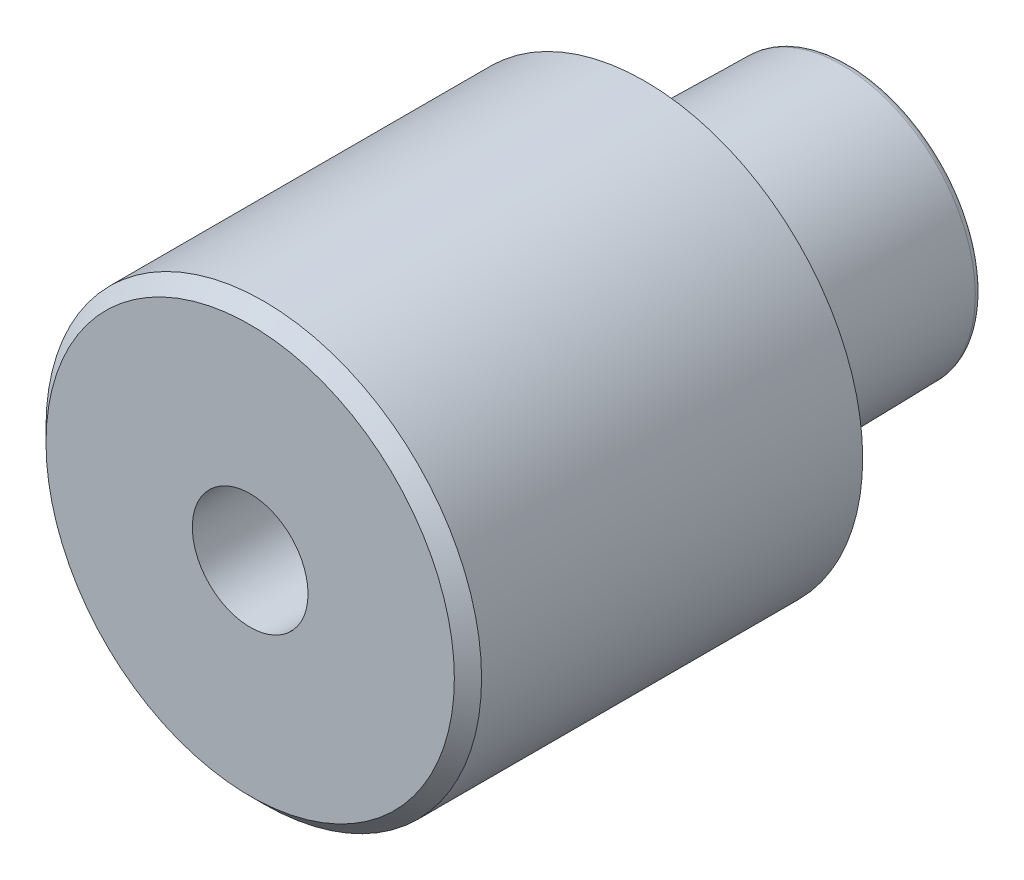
ISO-10303-21;
HEADER;
FILE_DESCRIPTION(('STEP AP214'),'2;1');
FILE_NAME('part.step','',(''),(''),'','','');
FILE_SCHEMA(('AUTOMOTIVE_DESIGN { 1 0 10303 214 1 1 1 1 }'));
ENDSEC;
DATA;
#1=APPLICATION_CONTEXT('core data for automotive mechanical design processes');
#2=APPLICATION_PROTOCOL_DEFINITION('international standard','automotive_design',2000,#1);
#3=PRODUCT_CONTEXT('',#1,'mechanical');
#4=PRODUCT('Part','Part','',(#3));
#5=PRODUCT_RELATED_PRODUCT_CATEGORY('part','',(#4));
#6=PRODUCT_DEFINITION_FORMATION('','',#4);
#7=PRODUCT_DEFINITION_CONTEXT('part definition',#1,'design');
#8=PRODUCT_DEFINITION('design','',#6,#7);
#9=PRODUCT_DEFINITION_SHAPE('','',#8);
#10=(LENGTH_UNIT() NAMED_UNIT(*) SI_UNIT(.MILLI.,.METRE.));
#11=(NAMED_UNIT(*) PLANE_ANGLE_UNIT() SI_UNIT($,.RADIAN.));
#12=(NAMED_UNIT(*) SI_UNIT($,.STERADIAN.) SOLID_ANGLE_UNIT());
#13=UNCERTAINTY_MEASURE_WITH_UNIT(LENGTH_MEASURE(1.E-05),#10,'distance_accuracy_value','');
#14=(GEOMETRIC_REPRESENTATION_CONTEXT(3) GLOBAL_UNCERTAINTY_ASSIGNED_CONTEXT((#13)) GLOBAL_UNIT_ASSIGNED_CONTEXT((#10,
#11,#12)) REPRESENTATION_CONTEXT('',''));
#15=CARTESIAN_POINT('',(0.,0.,0.));
#16=DIRECTION('',(0.,0.,1.));
#17=DIRECTION('',(1.,0.,0.));
#18=AXIS2_PLACEMENT_3D('',#15,#16,#17);
#19=CARTESIAN_POINT('',(1.56226912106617E-13,0.,22.3725830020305));
#20=DIRECTION('',(0.,0.,-1.));
#21=DIRECTION('',(1.,0.,0.));
#22=AXIS2_PLACEMENT_3D('',#19,#20,#21);
#23=CONICAL_SURFACE('',#22,22.6274169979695,0.785398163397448);
#24=CARTESIAN_POINT('',(2.09488880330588E-13,0.,30.));
#25=DIRECTION('',(0.,0.,-1.));
#26=DIRECTION('',(-1.,0.,0.));
#27=AXIS2_PLACEMENT_3D('',#24,#25,#26);
#28=CIRCLE('',#27,15.);
#29=CARTESIAN_POINT('',(-14.9999999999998,0.,30.));
#30=VERTEX_POINT('',#29);
#31=CARTESIAN_POINT('',(15.,0.,30.));
#32=VERTEX_POINT('',#31);
#33=EDGE_CURVE('E59',#30,#32,#28,.T.);
#34=ORIENTED_EDGE('',*,*,#33,.T.);
#35=CARTESIAN_POINT('',(15.0000010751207,0.,29.9999989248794));
#36=CARTESIAN_POINT('',(16.0000024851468,0.,28.9999975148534));
#37=B_SPLINE_CURVE_WITH_KNOTS('',1,(#35,#36),.UNSPECIFIED.,.F.,.F.,(2,2),(0.662912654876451,
0.707106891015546),.UNSPECIFIED.);
#38=CARTESIAN_POINT('',(16.,0.,29.));
#39=VERTEX_POINT('',#38);
#40=EDGE_CURVE('E46',#32,#39,#37,.T.);
#41=ORIENTED_EDGE('',*,*,#40,.T.);
#42=CARTESIAN_POINT('',(2.02505917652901E-13,0.,29.));
#43=DIRECTION('',(0.,0.,1.));
#44=DIRECTION('',(-1.,0.,0.));
#45=AXIS2_PLACEMENT_3D('',#42,#43,#44);
#46=CIRCLE('',#45,16.);
#47=CARTESIAN_POINT('',(-16.,0.,29.));
#48=VERTEX_POINT('',#47);
#49=EDGE_CURVE('E97',#39,#48,#46,.T.);
#50=ORIENTED_EDGE('',*,*,#49,.T.);
#51=CARTESIAN_POINT('',(2.02505917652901E-13,0.,29.));
#52=DIRECTION('',(0.,0.,1.));
#53=DIRECTION('',(-1.,0.,0.));
#54=AXIS2_PLACEMENT_3D('',#51,#52,#53);
#55=CIRCLE('',#54,16.);
#56=EDGE_CURVE('E11',#48,#39,#55,.T.);
#57=ORIENTED_EDGE('',*,*,#56,.T.);
#58=ORIENTED_EDGE('',*,*,#40,.F.);
#59=CARTESIAN_POINT('',(2.09488880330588E-13,0.,30.));
#60=DIRECTION('',(0.,0.,-1.));
#61=DIRECTION('',(-1.,0.,0.));
#62=AXIS2_PLACEMENT_3D('',#59,#60,#61);
#63=CIRCLE('',#62,15.);
#64=EDGE_CURVE('E94',#32,#30,#63,.T.);
#65=ORIENTED_EDGE('',*,*,#64,.T.);
#66=EDGE_LOOP('',(#34,#41,#50,#57,#58,#65));
#67=FACE_BOUND('',#66,.T.);
#68=ADVANCED_FACE('F38',(#67),#23,.T.);
#69=CARTESIAN_POINT('',(1.08235921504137E-13,0.,15.5));
#70=DIRECTION('',(0.,0.,-1.));
#71=DIRECTION('',(-1.,0.,0.));
#72=AXIS2_PLACEMENT_3D('',#69,#70,#71);
#73=CYLINDRICAL_SURFACE('',#72,16.);
#74=ORIENTED_EDGE('',*,*,#49,.F.);
#75=ORIENTED_EDGE('',*,*,#56,.F.);
#76=CARTESIAN_POINT('',(-16.,0.,29.0000010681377));
#77=CARTESIAN_POINT('',(-16.,0.,1.00000036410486));
#78=B_SPLINE_CURVE_WITH_KNOTS('',1,(#76,#77),.UNSPECIFIED.,.F.,.F.,(2,2),(0.0833333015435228,
0.916666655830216),.UNSPECIFIED.);
#79=CARTESIAN_POINT('',(-16.,0.,1.00000000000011));
#80=VERTEX_POINT('',#79);
#81=EDGE_CURVE('E132',#48,#80,#78,.T.);
#82=ORIENTED_EDGE('',*,*,#81,.T.);
#83=CARTESIAN_POINT('',(0.,0.,1.));
#84=DIRECTION('',(0.,0.,-1.));
#85=DIRECTION('',(-1.,0.,0.));
#86=AXIS2_PLACEMENT_3D('',#83,#84,#85);
#87=CIRCLE('',#86,16.);
#88=EDGE_CURVE('E137',#80,#80,#87,.T.);
#89=ORIENTED_EDGE('',*,*,#88,.F.);
#90=ORIENTED_EDGE('',*,*,#81,.F.);
#91=EDGE_LOOP('',(#74,#75,#82,#89,#90));
#92=FACE_BOUND('',#91,.T.);
#93=ADVANCED_FACE('F182',(#92),#73,.T.);
#94=CARTESIAN_POINT('',(-19.5,-31.1769145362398,30.));
#95=DIRECTION('',(0.,0.,1.));
#96=DIRECTION('',(1.,0.,0.));
#97=AXIS2_PLACEMENT_3D('',#94,#95,#96);
#98=PLANE('',#97);
#99=CARTESIAN_POINT('',(2.09488880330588E-13,0.,29.9999999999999));
#100=DIRECTION('',(0.,0.,1.));
#101=DIRECTION('',(1.,0.,0.));
#102=AXIS2_PLACEMENT_3D('',#99,#100,#101);
#103=CIRCLE('',#102,4.24999999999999);
#104=CARTESIAN_POINT('',(4.2500000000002,0.,29.9999999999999));
#105=VERTEX_POINT('',#104);
#106=EDGE_CURVE('E95',#105,#105,#103,.T.);
#107=ORIENTED_EDGE('',*,*,#106,.F.);
#108=EDGE_LOOP('',(#107));
#109=FACE_BOUND('',#108,.T.);
#110=ORIENTED_EDGE('',*,*,#64,.F.);
#111=ORIENTED_EDGE('',*,*,#33,.F.);
#112=EDGE_LOOP('',(#110,#111));
#113=FACE_BOUND('',#112,.T.);
#114=ADVANCED_FACE('F185',(#109,#113),#98,.T.);
#115=CARTESIAN_POINT('',(0.,0.,-13.5));
#116=DIRECTION('',(0.,0.,-1.));
#117=DIRECTION('',(-1.,0.,0.));
#118=AXIS2_PLACEMENT_3D('',#115,#116,#117);
#119=TOROIDAL_SURFACE('',#118,9.26428045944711,0.5);
#120=CARTESIAN_POINT('',(0.,0.,-13.5087262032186));
#121=DIRECTION('',(0.,0.,-1.));
#122=DIRECTION('',(-1.,0.,0.));
#123=AXIS2_PLACEMENT_3D('',#120,#121,#122);
#124=CIRCLE('',#123,9.76420430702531);
#125=CARTESIAN_POINT('',(-9.7642043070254,0.,-13.5087262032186));
#126=VERTEX_POINT('',#125);
#127=EDGE_CURVE('E138',#126,#126,#124,.T.);
#128=ORIENTED_EDGE('',*,*,#127,.T.);
#129=CARTESIAN_POINT('',(-9.7642043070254,0.,-13.5087262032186));
#130=CARTESIAN_POINT('',(-9.75562909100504,0.,-13.9999999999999));
#131=CARTESIAN_POINT('',(-9.26428045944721,0.,-14.));
#132=(BOUNDED_CURVE() B_SPLINE_CURVE(2,(#129,#130,#131),.UNSPECIFIED.,.F.,
.F.) B_SPLINE_CURVE_WITH_KNOTS((3,3),(0.,0.5),
.UNSPECIFIED.) CURVE() GEOMETRIC_REPRESENTATION_ITEM() RATIONAL_B_SPLINE_CURVE((1.,
0.713250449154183,1.)) REPRESENTATION_ITEM(''));
#133=CARTESIAN_POINT('',(-9.26428045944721,0.,-14.));
#134=VERTEX_POINT('',#133);
#135=EDGE_CURVE('E121',#126,#134,#132,.T.);
#136=ORIENTED_EDGE('',*,*,#135,.T.);
#137=CARTESIAN_POINT('',(0.,0.,-14.));
#138=DIRECTION('',(0.,0.,1.));
#139=DIRECTION('',(-1.,0.,0.));
#140=AXIS2_PLACEMENT_3D('',#137,#138,#139);
#141=CIRCLE('',#140,9.26428045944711);
#142=EDGE_CURVE('E127',#134,#134,#141,.T.);
#143=ORIENTED_EDGE('',*,*,#142,.T.);
#144=ORIENTED_EDGE('',*,*,#135,.F.);
#145=EDGE_LOOP('',(#128,#136,#143,#144));
#146=FACE_BOUND('',#145,.T.);
#147=ADVANCED_FACE('F187',(#146),#119,.T.);
#148=CARTESIAN_POINT('',(0.,0.,0.));
#149=DIRECTION('',(0.,0.,1.));
#150=DIRECTION('',(-1.,0.,0.));
#151=AXIS2_PLACEMENT_3D('',#148,#149,#150);
#152=CONICAL_SURFACE('',#151,10.,0.0174532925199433);
#153=ORIENTED_EDGE('',*,*,#127,.F.);
#154=CARTESIAN_POINT('',(-9.7642043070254,0.,-13.5087262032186));
#155=CARTESIAN_POINT('',(-10.,0.,0.));
#156=B_SPLINE_CURVE_WITH_KNOTS('',1,(#154,#155),.UNSPECIFIED.,.F.,.F.,(2,2),(0.,1.),.UNSPECIFIED.);
#157=CARTESIAN_POINT('',(-10.,0.,0.));
#158=VERTEX_POINT('',#157);
#159=EDGE_CURVE('E110',#126,#158,#156,.T.);
#160=ORIENTED_EDGE('',*,*,#159,.T.);
#161=CARTESIAN_POINT('',(0.,0.,0.));
#162=DIRECTION('',(0.,0.,-1.));
#163=DIRECTION('',(-1.,0.,0.));
#164=AXIS2_PLACEMENT_3D('',#161,#162,#163);
#165=CIRCLE('',#164,10.);
#166=EDGE_CURVE('E116',#158,#158,#165,.T.);
#167=ORIENTED_EDGE('',*,*,#166,.T.);
#168=ORIENTED_EDGE('',*,*,#159,.F.);
#169=EDGE_LOOP('',(#153,#160,#167,#168));
#170=FACE_BOUND('',#169,.T.);
#171=ADVANCED_FACE('F194',(#170),#152,.T.);
#172=CARTESIAN_POINT('',(21.3078450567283,-19.2554453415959,-14.0000000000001));
#173=DIRECTION('',(0.,0.,-1.));
#174=DIRECTION('',(-1.,0.,0.));
#175=AXIS2_PLACEMENT_3D('',#172,#173,#174);
#176=PLANE('',#175);
#177=ORIENTED_EDGE('',*,*,#142,.F.);
#178=EDGE_LOOP('',(#177));
#179=FACE_BOUND('',#178,.T.);
#180=ADVANCED_FACE('F222',(#179),#176,.T.);
#181=CARTESIAN_POINT('',(0.,0.,0.5));
#182=DIRECTION('',(0.,0.,-1.));
#183=DIRECTION('',(-1.,0.,0.));
#184=AXIS2_PLACEMENT_3D('',#181,#182,#183);
#185=CYLINDRICAL_SURFACE('',#184,10.);
#186=CARTESIAN_POINT('',(0.,0.,1.));
#187=DIRECTION('',(0.,0.,1.));
#188=DIRECTION('',(-1.,0.,0.));
#189=AXIS2_PLACEMENT_3D('',#186,#187,#188);
#190=CIRCLE('',#189,10.);
#191=CARTESIAN_POINT('',(-10.,0.,1.00000000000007));
#192=VERTEX_POINT('',#191);
#193=EDGE_CURVE('E105',#192,#192,#190,.T.);
#194=ORIENTED_EDGE('',*,*,#193,.F.);
#195=CARTESIAN_POINT('',(-10.,0.,1.00000305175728));
#196=CARTESIAN_POINT('',(-10.,0.,5.31746945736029E-07));
#197=B_SPLINE_CURVE_WITH_KNOTS('',1,(#195,#196),.UNSPECIFIED.,.F.,.F.,(2,2),(0.0833307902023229,
0.91666622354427),.UNSPECIFIED.);
#198=EDGE_CURVE('E102',#192,#158,#197,.T.);
#199=ORIENTED_EDGE('',*,*,#198,.T.);
#200=ORIENTED_EDGE('',*,*,#166,.F.);
#201=ORIENTED_EDGE('',*,*,#198,.F.);
#202=EDGE_LOOP('',(#194,#199,#200,#201));
#203=FACE_BOUND('',#202,.T.);
#204=ADVANCED_FACE('F231',(#203),#185,.T.);
#205=CARTESIAN_POINT('',(36.8,-33.2553755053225,0.999999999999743));
#206=DIRECTION('',(0.,0.,-1.));
#207=DIRECTION('',(-1.,0.,0.));
#208=AXIS2_PLACEMENT_3D('',#205,#206,#207);
#209=PLANE('',#208);
#210=ORIENTED_EDGE('',*,*,#88,.T.);
#211=EDGE_LOOP('',(#210));
#212=FACE_BOUND('',#211,.T.);
#213=ORIENTED_EDGE('',*,*,#193,.T.);
#214=EDGE_LOOP('',(#213));
#215=FACE_BOUND('',#214,.T.);
#216=ADVANCED_FACE('F88',(#212,#215),#209,.T.);
#217=CARTESIAN_POINT('',(2.09488880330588E-13,0.,7.99999999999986));
#218=DIRECTION('',(0.,0.,1.));
#219=DIRECTION('',(1.,0.,0.));
#220=AXIS2_PLACEMENT_3D('',#217,#218,#219);
#221=CONICAL_SURFACE('',#220,4.24999999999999,1.02974425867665);
#222=CARTESIAN_POINT('',(2.03474968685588E-13,0.,5.44634236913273));
#223=VERTEX_POINT('',#222);
#224=VERTEX_LOOP('',#223);
#225=FACE_BOUND('',#224,.T.);
#226=CARTESIAN_POINT('',(2.09488880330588E-13,0.,7.99999999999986));
#227=DIRECTION('',(0.,0.,1.));
#228=DIRECTION('',(1.,0.,0.));
#229=AXIS2_PLACEMENT_3D('',#226,#227,#228);
#230=CIRCLE('',#229,4.24999999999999);
#231=CARTESIAN_POINT('',(4.25000000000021,0.,7.99999999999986));
#232=VERTEX_POINT('',#231);
#233=EDGE_CURVE('E92',#232,#232,#230,.T.);
#234=ORIENTED_EDGE('',*,*,#233,.T.);
#235=EDGE_LOOP('',(#234));
#236=FACE_BOUND('',#235,.T.);
#237=ADVANCED_FACE('F84',(#225,#236),#221,.F.);
#238=CARTESIAN_POINT('',(2.09488880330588E-13,0.,29.9999999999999));
#239=DIRECTION('',(0.,0.,1.));
#240=DIRECTION('',(1.,0.,0.));
#241=AXIS2_PLACEMENT_3D('',#238,#239,#240);
#242=CYLINDRICAL_SURFACE('',#241,4.24999999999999);
#243=ORIENTED_EDGE('',*,*,#233,.F.);
#244=EDGE_LOOP('',(#243));
#245=FACE_BOUND('',#244,.T.);
#246=ORIENTED_EDGE('',*,*,#106,.T.);
#247=EDGE_LOOP('',(#246));
#248=FACE_BOUND('',#247,.T.);
#249=ADVANCED_FACE('F87',(#245,#248),#242,.F.);
#250=CLOSED_SHELL('',(#68,#93,#114,#147,#171,#180,#204,#216,#237,#249));
#251=MANIFOLD_SOLID_BREP('B2',#250);
#252=ADVANCED_BREP_SHAPE_REPRESENTATION('',(#18,#251),#14);
#253=SHAPE_DEFINITION_REPRESENTATION(#9,#252);
ENDSEC;
END-ISO-10303-21;
